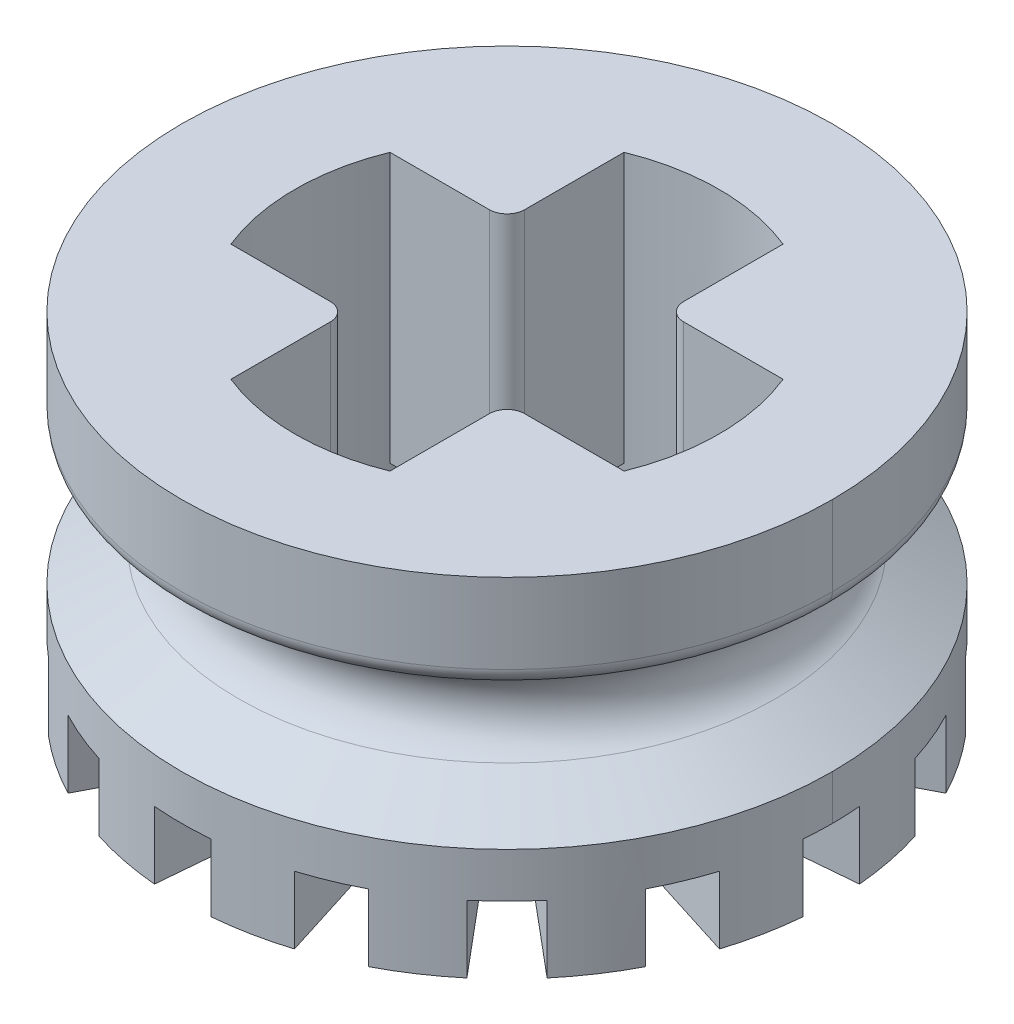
from build123d import *

# Parameters (mm, degrees)
SKETCH1_R           = 3.683
BASE_EXTRUDE_DEPTH  = 3.937
SKETCH2_R           = 2.3876
CUT_EXTRUDE1_DEPTH  = 7.529084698
CUT_EXTRUDE2_DEPTH  = 0.762
CIRPATTERN1_COUNT   = 16
BOSS_EXTRUDE1_DEPTH = 3.175
FILLET1_R           = 0.396875
FILLET2_R           = 0.1984375
SKETCH7_R           = 2.4
CUT_EXTRUDE3_DEPTH  = 3.937
BOSS_EXTRUDE3_DEPTH = 3.048
FILLET3_R           = 0.2


with BuildPart() as part:
    # Sketch1 → Base-Extrude (new body)
    with BuildSketch(Plane(origin=(0, 0, 0), x_dir=(1, 0, 0), z_dir=(0, 1, 0))):
        with Locations(Location((0, 0, 0), (0, 0, 270))):
            Circle(SKETCH1_R)
    extrude(amount=BASE_EXTRUDE_DEPTH)

    # Sketch2 → Cut-Extrude1 (cut, through all)
    with BuildSketch(Plane(origin=(0, 3.937, 0), x_dir=(-1, 0, 0), z_dir=(0, 1, 0))):
        with Locations(Location((0, 0, 0), (0, 0, 90))):
            Circle(SKETCH2_R)
    extrude(amount=-CUT_EXTRUDE1_DEPTH, mode=Mode.SUBTRACT)

    # Sketch4 → Cut-Revolve1 (revolve, cut)
    with BuildSketch(Plane.XY, mode=Mode.PRIVATE) as cut_revolve1_sk:
        with BuildLine():
            Line((3.683, 2.921), (3.038418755, 2.529768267))
            ThreePointArc((3.038418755, 2.529768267), (2.794, 2.0955), (3.038418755, 1.661231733))
            Line((3.038418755, 1.661231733), (3.683, 1.27))
            Line((3.683, 1.27), (3.683, 2.921))
        make_face()
    revolve(cut_revolve1_sk.sketch.rotate(Axis((0, 0, 0), (0, 1, 0)), 90), axis=Axis((0, 0, 0), (0, 1, 0)), mode=Mode.SUBTRACT)

    # Sketch5 → Cut-Extrude2 (cut)
    with BuildSketch(Plane(origin=(16.494267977, 0, 2.582932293), x_dir=(1, 0, 0), z_dir=(0, -1, 0))):
        with BuildLine():
            Line((-18.872782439, -2.374839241), (-20.163253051, -2.261937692))
            ThreePointArc((-20.163253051, -2.261937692), (-20.177267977, -2.582932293), (-20.163253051, -2.903926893))
            Line((-20.163253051, -2.903926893), (-18.872782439, -2.791025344))
            ThreePointArc((-18.872782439, -2.791025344), (-18.881867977, -2.582932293), (-18.872782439, -2.374839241))
        make_face()
    cut_extrude2 = extrude(amount=-CUT_EXTRUDE2_DEPTH, mode=Mode.SUBTRACT)

    # CirPattern1: Cut-Extrude2 ×16 about axis
    cirpattern1_axis = Axis((0, 0, 0), (0, 1, 0))
    for i in range(1, CIRPATTERN1_COUNT):
        add(cut_extrude2.rotate(cirpattern1_axis, i * 360 / CIRPATTERN1_COUNT), mode=Mode.SUBTRACT)

    # Sketch6 → Boss-Extrude1 (add)
    with BuildSketch(Plane(origin=(0, 3.937, 0), x_dir=(-1, 0, 0), z_dir=(0, 1, 0))):
        with BuildLine():
            Line((-0.92075, -2.202919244), (-0.92075, -0.92075))
            Line((-0.92075, -0.92075), (-2.202919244, -0.92075))
            ThreePointArc((-2.202919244, -0.92075), (-1.688288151, -1.688288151), (-0.92075, -2.202919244))
        make_face()
        with BuildLine():
            Line((2.202919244, 0.92075), (0.92075, 0.92075))
            Line((0.92075, 0.92075), (0.92075, 2.202919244))
            ThreePointArc((0.92075, 2.202919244), (1.688288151, 1.688288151), (2.202919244, 0.92075))
        make_face()
    extrude(amount=-BOSS_EXTRUDE1_DEPTH)

    # Fillet1
    fillet1_edges = [part.edges().sort_by_distance(p)[0] for p in [
        (0.92075, 2.3495, -0.92075),
        (-0.92075, 2.3495, 0.92075),
    ]]
    fillet(fillet1_edges, radius=FILLET1_R)

    # Fillet2
    fillet2_edges = [part.edges().sort_by_distance(p)[0] for p in [
        (-3.683, 2.921, 0),
        (-3.683, 2.921, 0),
    ]]
    fillet(fillet2_edges, radius=FILLET2_R)

    # Sketch7 → Cut-Extrude3 (cut)
    with BuildSketch(Plane(origin=(0, 3.937, 0), x_dir=(1, 0, 0), z_dir=(0, 1, 0))):
        with Locations(Location((0, 0, 0), (0, 0, 270))):
            Circle(SKETCH7_R)
    extrude(amount=-CUT_EXTRUDE3_DEPTH, mode=Mode.SUBTRACT)

    # Sketch8 → Boss-Extrude3 (add)
    with BuildSketch(Plane(origin=(0, 3.937, 0), x_dir=(1, 0, 0), z_dir=(0, 1, 0))):
        with BuildLine():
            Line((-2.224859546, 0.9), (-0.9, 0.9))
            Line((-0.9, 0.9), (-0.9, 2.224859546))
            ThreePointArc((-0.9, 2.224859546), (-1.697056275, 1.697056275), (-2.224859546, 0.9))
        make_face()
        with BuildLine():
            Line((-2.224859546, -0.9), (-0.9, -0.9))
            Line((-0.9, -0.9), (-0.9, -2.224859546))
            ThreePointArc((-0.9, -2.224859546), (-1.697056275, -1.697056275), (-2.224859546, -0.9))
        make_face()
        with BuildLine():
            Line((0.9, 2.224859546), (0.9, 0.9))
            Line((0.9, 0.9), (2.224859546, 0.9))
            ThreePointArc((2.224859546, 0.9), (1.697056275, 1.697056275), (0.9, 2.224859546))
        make_face()
        with BuildLine():
            Line((0.9, -0.9), (0.9, -2.224859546))
            ThreePointArc((0.9, -2.224859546), (1.697056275, -1.697056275), (2.224859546, -0.9))
            Line((2.224859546, -0.9), (0.9, -0.9))
        make_face()
    extrude(amount=-BOSS_EXTRUDE3_DEPTH)

    # Fillet3
    fillet3_edges = [part.edges().sort_by_distance(p)[0] for p in [
        (-0.9, 2.413, -0.9),
        (0.9, 2.413, 0.9),
        (0.9, 2.413, -0.9),
        (-0.9, 2.413, 0.9),
    ]]
    fillet(fillet3_edges, radius=FILLET3_R)


solid = part.part
